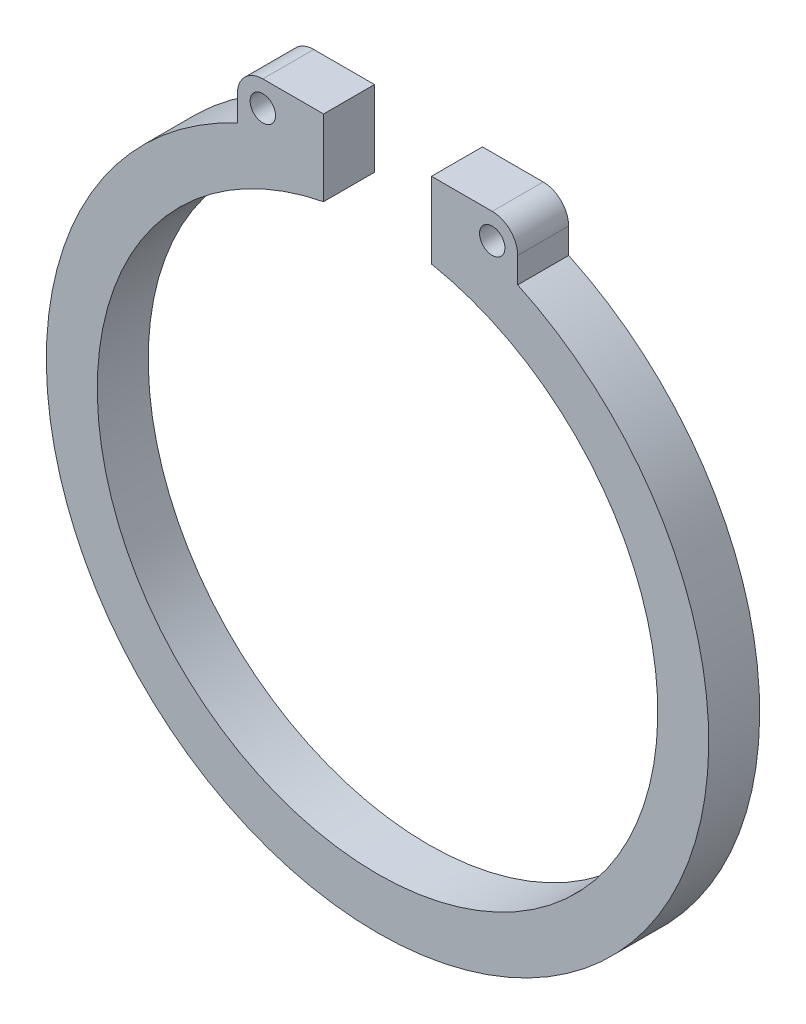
ISO-10303-21;
HEADER;
FILE_DESCRIPTION(('STEP AP214'),'2;1');
FILE_NAME('part.step','',(''),(''),'','','');
FILE_SCHEMA(('AUTOMOTIVE_DESIGN { 1 0 10303 214 1 1 1 1 }'));
ENDSEC;
DATA;
#1=APPLICATION_CONTEXT('core data for automotive mechanical design processes');
#2=APPLICATION_PROTOCOL_DEFINITION('international standard','automotive_design',2000,#1);
#3=PRODUCT_CONTEXT('',#1,'mechanical');
#4=PRODUCT('Part','Part','',(#3));
#5=PRODUCT_RELATED_PRODUCT_CATEGORY('part','',(#4));
#6=PRODUCT_DEFINITION_FORMATION('','',#4);
#7=PRODUCT_DEFINITION_CONTEXT('part definition',#1,'design');
#8=PRODUCT_DEFINITION('design','',#6,#7);
#9=PRODUCT_DEFINITION_SHAPE('','',#8);
#10=(LENGTH_UNIT() NAMED_UNIT(*) SI_UNIT(.MILLI.,.METRE.));
#11=(NAMED_UNIT(*) PLANE_ANGLE_UNIT() SI_UNIT($,.RADIAN.));
#12=(NAMED_UNIT(*) SI_UNIT($,.STERADIAN.) SOLID_ANGLE_UNIT());
#13=UNCERTAINTY_MEASURE_WITH_UNIT(LENGTH_MEASURE(1.E-05),#10,'distance_accuracy_value','');
#14=(GEOMETRIC_REPRESENTATION_CONTEXT(3) GLOBAL_UNCERTAINTY_ASSIGNED_CONTEXT((#13)) GLOBAL_UNIT_ASSIGNED_CONTEXT((#10,
#11,#12)) REPRESENTATION_CONTEXT('',''));
#15=CARTESIAN_POINT('',(0.,0.,0.));
#16=DIRECTION('',(0.,0.,1.));
#17=DIRECTION('',(1.,0.,0.));
#18=AXIS2_PLACEMENT_3D('',#15,#16,#17);
#19=CARTESIAN_POINT('',(0.,0.,1.));
#20=DIRECTION('',(0.,0.,1.));
#21=DIRECTION('',(1.,0.,0.));
#22=AXIS2_PLACEMENT_3D('',#19,#20,#21);
#23=PLANE('',#22);
#24=CARTESIAN_POINT('',(2.25122854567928,6.38903570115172,1.));
#25=DIRECTION('',(0.,0.,1.));
#26=DIRECTION('',(1.,0.,0.));
#27=AXIS2_PLACEMENT_3D('',#24,#25,#26);
#28=CIRCLE('',#27,0.249);
#29=CARTESIAN_POINT('',(2.50022854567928,6.38903570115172,1.));
#30=VERTEX_POINT('',#29);
#31=EDGE_CURVE('E120',#30,#30,#28,.T.);
#32=ORIENTED_EDGE('',*,*,#31,.F.);
#33=EDGE_LOOP('',(#32));
#34=FACE_BOUND('',#33,.T.);
#35=CARTESIAN_POINT('',(0.,0.,1.));
#36=DIRECTION('',(0.,0.,1.));
#37=DIRECTION('',(1.,0.,0.));
#38=AXIS2_PLACEMENT_3D('',#35,#36,#37);
#39=CIRCLE('',#38,6.5);
#40=CARTESIAN_POINT('',(-2.75122854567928,5.88903570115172,1.));
#41=VERTEX_POINT('',#40);
#42=CARTESIAN_POINT('',(2.75122854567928,5.88903570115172,1.));
#43=VERTEX_POINT('',#42);
#44=EDGE_CURVE('E142',#41,#43,#39,.T.);
#45=ORIENTED_EDGE('',*,*,#44,.T.);
#46=DIRECTION('',(0.,1.,0.));
#47=VECTOR('',#46,1.);
#48=CARTESIAN_POINT('',(2.75122854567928,5.88903570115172,1.));
#49=LINE('',#48,#47);
#50=CARTESIAN_POINT('',(2.75122854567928,6.38903570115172,1.));
#51=VERTEX_POINT('',#50);
#52=EDGE_CURVE('E115',#43,#51,#49,.T.);
#53=ORIENTED_EDGE('',*,*,#52,.T.);
#54=CARTESIAN_POINT('',(2.25122854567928,6.38903570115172,1.));
#55=DIRECTION('',(0.,0.,1.));
#56=DIRECTION('',(-1.,0.,0.));
#57=AXIS2_PLACEMENT_3D('',#54,#55,#56);
#58=CIRCLE('',#57,0.5);
#59=CARTESIAN_POINT('',(2.25122854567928,6.88903570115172,1.));
#60=VERTEX_POINT('',#59);
#61=EDGE_CURVE('E145',#51,#60,#58,.T.);
#62=ORIENTED_EDGE('',*,*,#61,.T.);
#63=DIRECTION('',(-1.,0.,0.));
#64=VECTOR('',#63,1.);
#65=CARTESIAN_POINT('',(2.25122854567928,6.88903570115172,1.));
#66=LINE('',#65,#64);
#67=CARTESIAN_POINT('',(1.05914766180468,6.88903570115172,1.));
#68=VERTEX_POINT('',#67);
#69=EDGE_CURVE('E147',#60,#68,#66,.T.);
#70=ORIENTED_EDGE('',*,*,#69,.T.);
#71=DIRECTION('',(0.,-1.,0.));
#72=VECTOR('',#71,1.);
#73=CARTESIAN_POINT('',(1.05914766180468,5.39705532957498,1.));
#74=LINE('',#73,#72);
#75=CARTESIAN_POINT('',(1.05914766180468,5.39705532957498,1.));
#76=VERTEX_POINT('',#75);
#77=EDGE_CURVE('E149',#68,#76,#74,.T.);
#78=ORIENTED_EDGE('',*,*,#77,.T.);
#79=CARTESIAN_POINT('',(0.,0.,1.));
#80=DIRECTION('',(0.,0.,-1.));
#81=DIRECTION('',(1.,0.,0.));
#82=AXIS2_PLACEMENT_3D('',#79,#80,#81);
#83=CIRCLE('',#82,5.5);
#84=CARTESIAN_POINT('',(-1.05914766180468,5.39705532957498,1.));
#85=VERTEX_POINT('',#84);
#86=EDGE_CURVE('E151',#76,#85,#83,.T.);
#87=ORIENTED_EDGE('',*,*,#86,.T.);
#88=DIRECTION('',(0.,1.,0.));
#89=VECTOR('',#88,1.);
#90=CARTESIAN_POINT('',(-1.05914766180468,5.39705532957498,1.));
#91=LINE('',#90,#89);
#92=CARTESIAN_POINT('',(-1.05914766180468,6.88903570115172,1.));
#93=VERTEX_POINT('',#92);
#94=EDGE_CURVE('E153',#85,#93,#91,.T.);
#95=ORIENTED_EDGE('',*,*,#94,.T.);
#96=DIRECTION('',(-1.,0.,0.));
#97=VECTOR('',#96,1.);
#98=CARTESIAN_POINT('',(-1.05914766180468,6.88903570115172,1.));
#99=LINE('',#98,#97);
#100=CARTESIAN_POINT('',(-2.25122854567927,6.88903570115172,1.));
#101=VERTEX_POINT('',#100);
#102=EDGE_CURVE('E155',#93,#101,#99,.T.);
#103=ORIENTED_EDGE('',*,*,#102,.T.);
#104=CARTESIAN_POINT('',(-2.25122854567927,6.38903570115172,1.));
#105=DIRECTION('',(0.,0.,1.));
#106=DIRECTION('',(1.,0.,0.));
#107=AXIS2_PLACEMENT_3D('',#104,#105,#106);
#108=CIRCLE('',#107,0.5);
#109=CARTESIAN_POINT('',(-2.75122854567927,6.38903570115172,1.));
#110=VERTEX_POINT('',#109);
#111=EDGE_CURVE('E44',#101,#110,#108,.T.);
#112=ORIENTED_EDGE('',*,*,#111,.T.);
#113=DIRECTION('',(0.,-1.,0.));
#114=VECTOR('',#113,1.);
#115=CARTESIAN_POINT('',(-2.75122854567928,5.88903570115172,1.));
#116=LINE('',#115,#114);
#117=EDGE_CURVE('E39',#110,#41,#116,.T.);
#118=ORIENTED_EDGE('',*,*,#117,.T.);
#119=EDGE_LOOP('',(#45,#53,#62,#70,#78,#87,#95,#103,#112,#118));
#120=FACE_BOUND('',#119,.T.);
#121=CARTESIAN_POINT('',(-2.25122854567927,6.38903570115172,1.));
#122=DIRECTION('',(0.,0.,1.));
#123=DIRECTION('',(-1.,0.,0.));
#124=AXIS2_PLACEMENT_3D('',#121,#122,#123);
#125=CIRCLE('',#124,0.248999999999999);
#126=CARTESIAN_POINT('',(-2.50022854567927,6.38903570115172,1.));
#127=VERTEX_POINT('',#126);
#128=EDGE_CURVE('E242',#127,#127,#125,.T.);
#129=ORIENTED_EDGE('',*,*,#128,.F.);
#130=EDGE_LOOP('',(#129));
#131=FACE_BOUND('',#130,.T.);
#132=ADVANCED_FACE('F24',(#34,#120,#131),#23,.T.);
#133=CARTESIAN_POINT('',(0.,0.,0.));
#134=DIRECTION('',(0.,0.,1.));
#135=DIRECTION('',(1.,0.,0.));
#136=AXIS2_PLACEMENT_3D('',#133,#134,#135);
#137=PLANE('',#136);
#138=CARTESIAN_POINT('',(2.25122854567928,6.38903570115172,0.));
#139=DIRECTION('',(0.,0.,1.));
#140=DIRECTION('',(1.,0.,0.));
#141=AXIS2_PLACEMENT_3D('',#138,#139,#140);
#142=CIRCLE('',#141,0.249);
#143=CARTESIAN_POINT('',(2.50022854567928,6.38903570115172,0.));
#144=VERTEX_POINT('',#143);
#145=EDGE_CURVE('E123',#144,#144,#142,.T.);
#146=ORIENTED_EDGE('',*,*,#145,.T.);
#147=EDGE_LOOP('',(#146));
#148=FACE_BOUND('',#147,.T.);
#149=CARTESIAN_POINT('',(0.,0.,0.));
#150=DIRECTION('',(0.,0.,1.));
#151=DIRECTION('',(1.,0.,0.));
#152=AXIS2_PLACEMENT_3D('',#149,#150,#151);
#153=CIRCLE('',#152,6.5);
#154=CARTESIAN_POINT('',(-2.75122854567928,5.88903570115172,0.));
#155=VERTEX_POINT('',#154);
#156=CARTESIAN_POINT('',(2.75122854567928,5.88903570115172,0.));
#157=VERTEX_POINT('',#156);
#158=EDGE_CURVE('E106',#155,#157,#153,.T.);
#159=ORIENTED_EDGE('',*,*,#158,.F.);
#160=DIRECTION('',(0.,-1.,0.));
#161=VECTOR('',#160,1.);
#162=CARTESIAN_POINT('',(-2.75122854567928,5.88903570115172,0.));
#163=LINE('',#162,#161);
#164=CARTESIAN_POINT('',(-2.75122854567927,6.38903570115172,0.));
#165=VERTEX_POINT('',#164);
#166=EDGE_CURVE('E140',#165,#155,#163,.T.);
#167=ORIENTED_EDGE('',*,*,#166,.F.);
#168=CARTESIAN_POINT('',(-2.25122854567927,6.38903570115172,0.));
#169=DIRECTION('',(0.,0.,1.));
#170=DIRECTION('',(1.,0.,0.));
#171=AXIS2_PLACEMENT_3D('',#168,#169,#170);
#172=CIRCLE('',#171,0.5);
#173=CARTESIAN_POINT('',(-2.25122854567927,6.88903570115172,0.));
#174=VERTEX_POINT('',#173);
#175=EDGE_CURVE('E138',#174,#165,#172,.T.);
#176=ORIENTED_EDGE('',*,*,#175,.F.);
#177=DIRECTION('',(-1.,0.,0.));
#178=VECTOR('',#177,1.);
#179=CARTESIAN_POINT('',(-1.05914766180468,6.88903570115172,0.));
#180=LINE('',#179,#178);
#181=CARTESIAN_POINT('',(-1.05914766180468,6.88903570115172,0.));
#182=VERTEX_POINT('',#181);
#183=EDGE_CURVE('E136',#182,#174,#180,.T.);
#184=ORIENTED_EDGE('',*,*,#183,.F.);
#185=DIRECTION('',(0.,1.,0.));
#186=VECTOR('',#185,1.);
#187=CARTESIAN_POINT('',(-1.05914766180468,5.39705532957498,0.));
#188=LINE('',#187,#186);
#189=CARTESIAN_POINT('',(-1.05914766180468,5.39705532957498,0.));
#190=VERTEX_POINT('',#189);
#191=EDGE_CURVE('E134',#190,#182,#188,.T.);
#192=ORIENTED_EDGE('',*,*,#191,.F.);
#193=CARTESIAN_POINT('',(0.,0.,0.));
#194=DIRECTION('',(0.,0.,-1.));
#195=DIRECTION('',(1.,0.,0.));
#196=AXIS2_PLACEMENT_3D('',#193,#194,#195);
#197=CIRCLE('',#196,5.5);
#198=CARTESIAN_POINT('',(1.05914766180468,5.39705532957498,0.));
#199=VERTEX_POINT('',#198);
#200=EDGE_CURVE('E132',#199,#190,#197,.T.);
#201=ORIENTED_EDGE('',*,*,#200,.F.);
#202=DIRECTION('',(0.,-1.,0.));
#203=VECTOR('',#202,1.);
#204=CARTESIAN_POINT('',(1.05914766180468,5.39705532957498,0.));
#205=LINE('',#204,#203);
#206=CARTESIAN_POINT('',(1.05914766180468,6.88903570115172,0.));
#207=VERTEX_POINT('',#206);
#208=EDGE_CURVE('E130',#207,#199,#205,.T.);
#209=ORIENTED_EDGE('',*,*,#208,.F.);
#210=DIRECTION('',(-1.,0.,0.));
#211=VECTOR('',#210,1.);
#212=CARTESIAN_POINT('',(2.25122854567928,6.88903570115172,0.));
#213=LINE('',#212,#211);
#214=CARTESIAN_POINT('',(2.25122854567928,6.88903570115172,0.));
#215=VERTEX_POINT('',#214);
#216=EDGE_CURVE('E128',#215,#207,#213,.T.);
#217=ORIENTED_EDGE('',*,*,#216,.F.);
#218=CARTESIAN_POINT('',(2.25122854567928,6.38903570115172,0.));
#219=DIRECTION('',(0.,0.,1.));
#220=DIRECTION('',(-1.,0.,0.));
#221=AXIS2_PLACEMENT_3D('',#218,#219,#220);
#222=CIRCLE('',#221,0.5);
#223=CARTESIAN_POINT('',(2.75122854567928,6.38903570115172,0.));
#224=VERTEX_POINT('',#223);
#225=EDGE_CURVE('E108',#224,#215,#222,.T.);
#226=ORIENTED_EDGE('',*,*,#225,.F.);
#227=DIRECTION('',(0.,1.,0.));
#228=VECTOR('',#227,1.);
#229=CARTESIAN_POINT('',(2.75122854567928,5.88903570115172,0.));
#230=LINE('',#229,#228);
#231=EDGE_CURVE('E101',#157,#224,#230,.T.);
#232=ORIENTED_EDGE('',*,*,#231,.F.);
#233=EDGE_LOOP('',(#159,#167,#176,#184,#192,#201,#209,#217,#226,#232));
#234=FACE_BOUND('',#233,.T.);
#235=CARTESIAN_POINT('',(-2.25122854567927,6.38903570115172,0.));
#236=DIRECTION('',(0.,0.,1.));
#237=DIRECTION('',(-1.,0.,0.));
#238=AXIS2_PLACEMENT_3D('',#235,#236,#237);
#239=CIRCLE('',#238,0.248999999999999);
#240=CARTESIAN_POINT('',(-2.50022854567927,6.38903570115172,0.));
#241=VERTEX_POINT('',#240);
#242=EDGE_CURVE('E245',#241,#241,#239,.T.);
#243=ORIENTED_EDGE('',*,*,#242,.T.);
#244=EDGE_LOOP('',(#243));
#245=FACE_BOUND('',#244,.T.);
#246=ADVANCED_FACE('F102',(#148,#234,#245),#137,.F.);
#247=CARTESIAN_POINT('',(0.,0.,1.));
#248=DIRECTION('',(0.,0.,-1.));
#249=DIRECTION('',(-1.,0.,0.));
#250=AXIS2_PLACEMENT_3D('',#247,#248,#249);
#251=CYLINDRICAL_SURFACE('',#250,6.5);
#252=ORIENTED_EDGE('',*,*,#158,.T.);
#253=DIRECTION('',(0.,0.,-1.));
#254=VECTOR('',#253,1.);
#255=CARTESIAN_POINT('',(2.75122854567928,5.88903570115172,1.));
#256=LINE('',#255,#254);
#257=EDGE_CURVE('E11',#43,#157,#256,.T.);
#258=ORIENTED_EDGE('',*,*,#257,.F.);
#259=ORIENTED_EDGE('',*,*,#44,.F.);
#260=DIRECTION('',(0.,0.,-1.));
#261=VECTOR('',#260,1.);
#262=CARTESIAN_POINT('',(-2.75122854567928,5.88903570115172,1.));
#263=LINE('',#262,#261);
#264=EDGE_CURVE('E119',#41,#155,#263,.T.);
#265=ORIENTED_EDGE('',*,*,#264,.T.);
#266=EDGE_LOOP('',(#252,#258,#259,#265));
#267=FACE_BOUND('',#266,.T.);
#268=ADVANCED_FACE('F26',(#267),#251,.T.);
#269=CARTESIAN_POINT('',(2.75122854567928,5.88903570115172,1.));
#270=DIRECTION('',(-1.,0.,0.));
#271=DIRECTION('',(0.,-1.,0.));
#272=AXIS2_PLACEMENT_3D('',#269,#270,#271);
#273=PLANE('',#272);
#274=ORIENTED_EDGE('',*,*,#231,.T.);
#275=DIRECTION('',(0.,0.,-1.));
#276=VECTOR('',#275,1.);
#277=CARTESIAN_POINT('',(2.75122854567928,6.38903570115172,1.));
#278=LINE('',#277,#276);
#279=EDGE_CURVE('E32',#51,#224,#278,.T.);
#280=ORIENTED_EDGE('',*,*,#279,.F.);
#281=ORIENTED_EDGE('',*,*,#52,.F.);
#282=ORIENTED_EDGE('',*,*,#257,.T.);
#283=EDGE_LOOP('',(#274,#280,#281,#282));
#284=FACE_BOUND('',#283,.T.);
#285=ADVANCED_FACE('F114',(#284),#273,.F.);
#286=CARTESIAN_POINT('',(2.25122854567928,6.38903570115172,1.));
#287=DIRECTION('',(0.,0.,-1.));
#288=DIRECTION('',(-1.,0.,0.));
#289=AXIS2_PLACEMENT_3D('',#286,#287,#288);
#290=CYLINDRICAL_SURFACE('',#289,0.5);
#291=ORIENTED_EDGE('',*,*,#225,.T.);
#292=DIRECTION('',(0.,0.,-1.));
#293=VECTOR('',#292,1.);
#294=CARTESIAN_POINT('',(2.25122854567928,6.88903570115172,1.));
#295=LINE('',#294,#293);
#296=EDGE_CURVE('E178',#60,#215,#295,.T.);
#297=ORIENTED_EDGE('',*,*,#296,.F.);
#298=ORIENTED_EDGE('',*,*,#61,.F.);
#299=ORIENTED_EDGE('',*,*,#279,.T.);
#300=EDGE_LOOP('',(#291,#297,#298,#299));
#301=FACE_BOUND('',#300,.T.);
#302=ADVANCED_FACE('F182',(#301),#290,.T.);
#303=CARTESIAN_POINT('',(2.25122854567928,6.88903570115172,1.));
#304=DIRECTION('',(0.,-1.,0.));
#305=DIRECTION('',(1.,0.,0.));
#306=AXIS2_PLACEMENT_3D('',#303,#304,#305);
#307=PLANE('',#306);
#308=ORIENTED_EDGE('',*,*,#216,.T.);
#309=DIRECTION('',(0.,0.,-1.));
#310=VECTOR('',#309,1.);
#311=CARTESIAN_POINT('',(1.05914766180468,6.88903570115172,1.));
#312=LINE('',#311,#310);
#313=EDGE_CURVE('E175',#68,#207,#312,.T.);
#314=ORIENTED_EDGE('',*,*,#313,.F.);
#315=ORIENTED_EDGE('',*,*,#69,.F.);
#316=ORIENTED_EDGE('',*,*,#296,.T.);
#317=EDGE_LOOP('',(#308,#314,#315,#316));
#318=FACE_BOUND('',#317,.T.);
#319=ADVANCED_FACE('F190',(#318),#307,.F.);
#320=CARTESIAN_POINT('',(1.05914766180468,5.39705532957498,1.));
#321=DIRECTION('',(1.,0.,0.));
#322=DIRECTION('',(0.,1.,0.));
#323=AXIS2_PLACEMENT_3D('',#320,#321,#322);
#324=PLANE('',#323);
#325=ORIENTED_EDGE('',*,*,#208,.T.);
#326=DIRECTION('',(0.,0.,-1.));
#327=VECTOR('',#326,1.);
#328=CARTESIAN_POINT('',(1.05914766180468,5.39705532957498,1.));
#329=LINE('',#328,#327);
#330=EDGE_CURVE('E172',#76,#199,#329,.T.);
#331=ORIENTED_EDGE('',*,*,#330,.F.);
#332=ORIENTED_EDGE('',*,*,#77,.F.);
#333=ORIENTED_EDGE('',*,*,#313,.T.);
#334=EDGE_LOOP('',(#325,#331,#332,#333));
#335=FACE_BOUND('',#334,.T.);
#336=ADVANCED_FACE('F193',(#335),#324,.F.);
#337=CARTESIAN_POINT('',(0.,0.,1.));
#338=DIRECTION('',(0.,0.,-1.));
#339=DIRECTION('',(-1.,0.,0.));
#340=AXIS2_PLACEMENT_3D('',#337,#338,#339);
#341=CYLINDRICAL_SURFACE('',#340,5.5);
#342=ORIENTED_EDGE('',*,*,#200,.T.);
#343=DIRECTION('',(0.,0.,-1.));
#344=VECTOR('',#343,1.);
#345=CARTESIAN_POINT('',(-1.05914766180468,5.39705532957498,1.));
#346=LINE('',#345,#344);
#347=EDGE_CURVE('E169',#85,#190,#346,.T.);
#348=ORIENTED_EDGE('',*,*,#347,.F.);
#349=ORIENTED_EDGE('',*,*,#86,.F.);
#350=ORIENTED_EDGE('',*,*,#330,.T.);
#351=EDGE_LOOP('',(#342,#348,#349,#350));
#352=FACE_BOUND('',#351,.T.);
#353=ADVANCED_FACE('F198',(#352),#341,.F.);
#354=CARTESIAN_POINT('',(-1.05914766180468,5.39705532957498,1.));
#355=DIRECTION('',(-1.,0.,0.));
#356=DIRECTION('',(0.,-1.,0.));
#357=AXIS2_PLACEMENT_3D('',#354,#355,#356);
#358=PLANE('',#357);
#359=ORIENTED_EDGE('',*,*,#191,.T.);
#360=DIRECTION('',(0.,0.,-1.));
#361=VECTOR('',#360,1.);
#362=CARTESIAN_POINT('',(-1.05914766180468,6.88903570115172,1.));
#363=LINE('',#362,#361);
#364=EDGE_CURVE('E166',#93,#182,#363,.T.);
#365=ORIENTED_EDGE('',*,*,#364,.F.);
#366=ORIENTED_EDGE('',*,*,#94,.F.);
#367=ORIENTED_EDGE('',*,*,#347,.T.);
#368=EDGE_LOOP('',(#359,#365,#366,#367));
#369=FACE_BOUND('',#368,.T.);
#370=ADVANCED_FACE('F204',(#369),#358,.F.);
#371=CARTESIAN_POINT('',(-1.05914766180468,6.88903570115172,1.));
#372=DIRECTION('',(0.,-1.,0.));
#373=DIRECTION('',(1.,0.,0.));
#374=AXIS2_PLACEMENT_3D('',#371,#372,#373);
#375=PLANE('',#374);
#376=ORIENTED_EDGE('',*,*,#183,.T.);
#377=DIRECTION('',(0.,0.,-1.));
#378=VECTOR('',#377,1.);
#379=CARTESIAN_POINT('',(-2.25122854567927,6.88903570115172,1.));
#380=LINE('',#379,#378);
#381=EDGE_CURVE('E163',#101,#174,#380,.T.);
#382=ORIENTED_EDGE('',*,*,#381,.F.);
#383=ORIENTED_EDGE('',*,*,#102,.F.);
#384=ORIENTED_EDGE('',*,*,#364,.T.);
#385=EDGE_LOOP('',(#376,#382,#383,#384));
#386=FACE_BOUND('',#385,.T.);
#387=ADVANCED_FACE('F208',(#386),#375,.F.);
#388=CARTESIAN_POINT('',(-2.25122854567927,6.38903570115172,1.));
#389=DIRECTION('',(0.,0.,-1.));
#390=DIRECTION('',(-1.,0.,0.));
#391=AXIS2_PLACEMENT_3D('',#388,#389,#390);
#392=CYLINDRICAL_SURFACE('',#391,0.5);
#393=ORIENTED_EDGE('',*,*,#175,.T.);
#394=DIRECTION('',(0.,0.,-1.));
#395=VECTOR('',#394,1.);
#396=CARTESIAN_POINT('',(-2.75122854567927,6.38903570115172,1.));
#397=LINE('',#396,#395);
#398=EDGE_CURVE('E160',#110,#165,#397,.T.);
#399=ORIENTED_EDGE('',*,*,#398,.F.);
#400=ORIENTED_EDGE('',*,*,#111,.F.);
#401=ORIENTED_EDGE('',*,*,#381,.T.);
#402=EDGE_LOOP('',(#393,#399,#400,#401));
#403=FACE_BOUND('',#402,.T.);
#404=ADVANCED_FACE('F211',(#403),#392,.T.);
#405=CARTESIAN_POINT('',(-2.75122854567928,5.88903570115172,1.));
#406=DIRECTION('',(1.,0.,0.));
#407=DIRECTION('',(0.,1.,0.));
#408=AXIS2_PLACEMENT_3D('',#405,#406,#407);
#409=PLANE('',#408);
#410=ORIENTED_EDGE('',*,*,#166,.T.);
#411=ORIENTED_EDGE('',*,*,#264,.F.);
#412=ORIENTED_EDGE('',*,*,#117,.F.);
#413=ORIENTED_EDGE('',*,*,#398,.T.);
#414=EDGE_LOOP('',(#410,#411,#412,#413));
#415=FACE_BOUND('',#414,.T.);
#416=ADVANCED_FACE('F213',(#415),#409,.F.);
#417=CARTESIAN_POINT('',(2.25122854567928,6.38903570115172,1.));
#418=DIRECTION('',(0.,0.,-1.));
#419=DIRECTION('',(-1.,0.,0.));
#420=AXIS2_PLACEMENT_3D('',#417,#418,#419);
#421=CYLINDRICAL_SURFACE('',#420,0.249);
#422=ORIENTED_EDGE('',*,*,#31,.T.);
#423=EDGE_LOOP('',(#422));
#424=FACE_BOUND('',#423,.T.);
#425=ORIENTED_EDGE('',*,*,#145,.F.);
#426=EDGE_LOOP('',(#425));
#427=FACE_BOUND('',#426,.T.);
#428=ADVANCED_FACE('F215',(#424,#427),#421,.F.);
#429=CARTESIAN_POINT('',(-2.25122854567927,6.38903570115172,1.));
#430=DIRECTION('',(0.,0.,-1.));
#431=DIRECTION('',(-1.,0.,0.));
#432=AXIS2_PLACEMENT_3D('',#429,#430,#431);
#433=CYLINDRICAL_SURFACE('',#432,0.248999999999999);
#434=ORIENTED_EDGE('',*,*,#128,.T.);
#435=EDGE_LOOP('',(#434));
#436=FACE_BOUND('',#435,.T.);
#437=ORIENTED_EDGE('',*,*,#242,.F.);
#438=EDGE_LOOP('',(#437));
#439=FACE_BOUND('',#438,.T.);
#440=ADVANCED_FACE('F221',(#436,#439),#433,.F.);
#441=CLOSED_SHELL('',(#132,#246,#268,#285,#302,#319,#336,#353,#370,#387,#404,#416,#428,#440));
#442=MANIFOLD_SOLID_BREP('B2',#441);
#443=ADVANCED_BREP_SHAPE_REPRESENTATION('',(#18,#442),#14);
#444=SHAPE_DEFINITION_REPRESENTATION(#9,#443);
ENDSEC;
END-ISO-10303-21;
